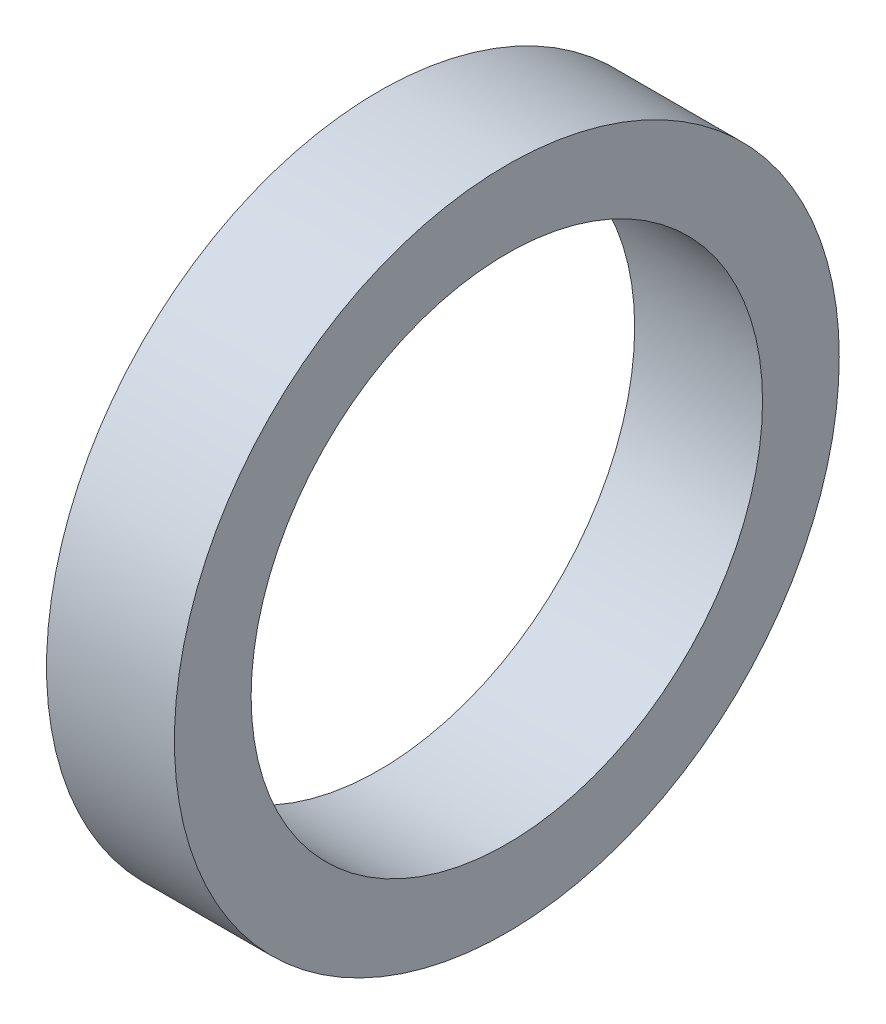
from build123d import *

# Parameters (mm, degrees)
ESQUISSE1_R   = 13
ESQUISSE1_R_2 = 10
BASE_DEPTH    = 5


with BuildPart() as part:
    # Esquisse1 → BASE (new body)
    with BuildSketch(Plane(origin=(0, 0, 0), x_dir=(0, 0, -1), z_dir=(1, 0, 0))):
        Circle(ESQUISSE1_R)
        Circle(ESQUISSE1_R_2, mode=Mode.SUBTRACT)
    extrude(amount=-BASE_DEPTH)


solid = part.part
